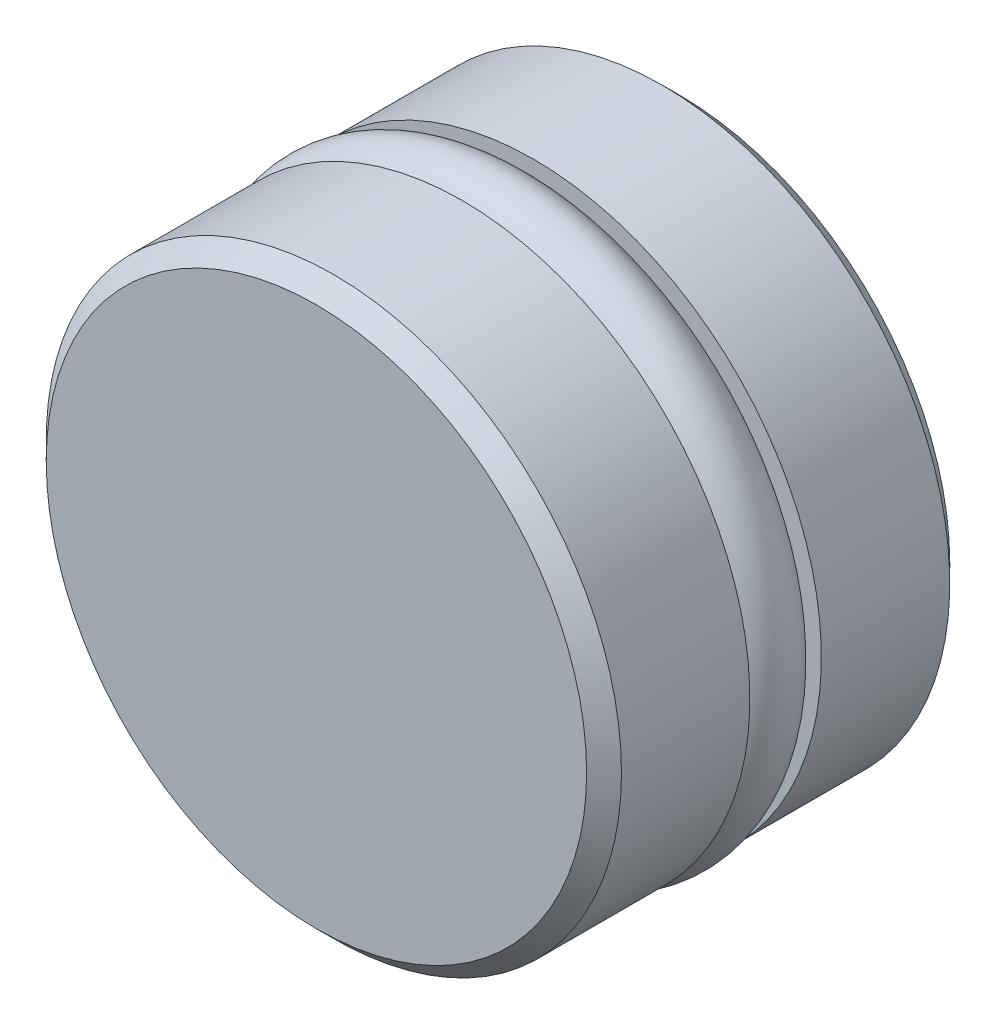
ISO-10303-21;
HEADER;
FILE_DESCRIPTION(('STEP AP214'),'2;1');
FILE_NAME('part.step','',(''),(''),'','','');
FILE_SCHEMA(('AUTOMOTIVE_DESIGN { 1 0 10303 214 1 1 1 1 }'));
ENDSEC;
DATA;
#1=APPLICATION_CONTEXT('core data for automotive mechanical design processes');
#2=APPLICATION_PROTOCOL_DEFINITION('international standard','automotive_design',2000,#1);
#3=PRODUCT_CONTEXT('',#1,'mechanical');
#4=PRODUCT('Part','Part','',(#3));
#5=PRODUCT_RELATED_PRODUCT_CATEGORY('part','',(#4));
#6=PRODUCT_DEFINITION_FORMATION('','',#4);
#7=PRODUCT_DEFINITION_CONTEXT('part definition',#1,'design');
#8=PRODUCT_DEFINITION('design','',#6,#7);
#9=PRODUCT_DEFINITION_SHAPE('','',#8);
#10=(LENGTH_UNIT() NAMED_UNIT(*) SI_UNIT(.MILLI.,.METRE.));
#11=(NAMED_UNIT(*) PLANE_ANGLE_UNIT() SI_UNIT($,.RADIAN.));
#12=(NAMED_UNIT(*) SI_UNIT($,.STERADIAN.) SOLID_ANGLE_UNIT());
#13=UNCERTAINTY_MEASURE_WITH_UNIT(LENGTH_MEASURE(1.E-05),#10,'distance_accuracy_value','');
#14=(GEOMETRIC_REPRESENTATION_CONTEXT(3) GLOBAL_UNCERTAINTY_ASSIGNED_CONTEXT((#13)) GLOBAL_UNIT_ASSIGNED_CONTEXT((#10,
#11,#12)) REPRESENTATION_CONTEXT('',''));
#15=CARTESIAN_POINT('',(0.,0.,0.));
#16=DIRECTION('',(0.,0.,1.));
#17=DIRECTION('',(1.,0.,0.));
#18=AXIS2_PLACEMENT_3D('',#15,#16,#17);
#19=CARTESIAN_POINT('',(0.,0.,7.9375));
#20=DIRECTION('',(0.,0.,-1.));
#21=DIRECTION('',(-1.,0.,0.));
#22=AXIS2_PLACEMENT_3D('',#19,#20,#21);
#23=TOROIDAL_SURFACE('',#22,11.2141,1.5875);
#24=CARTESIAN_POINT('',(-12.8016,0.,7.9375));
#25=VERTEX_POINT('',#24);
#26=VERTEX_LOOP('',#25);
#27=FACE_BOUND('',#26,.T.);
#28=ADVANCED_FACE('P0_F12',(#27),#23,.T.);
#29=CLOSED_SHELL('',(#28));
#30=MANIFOLD_SOLID_BREP('P0_B1',#29);
#31=CARTESIAN_POINT('',(0.,0.,9.59455189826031));
#32=DIRECTION('',(0.,0.,-1.));
#33=DIRECTION('',(-1.,0.,0.));
#34=AXIS2_PLACEMENT_3D('',#31,#32,#33);
#35=CONICAL_SURFACE('',#34,3.87095999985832,1.0274700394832);
#36=CARTESIAN_POINT('',(0.,0.,9.59455189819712));
#37=DIRECTION('',(0.,0.,-1.));
#38=DIRECTION('',(0.,1.,0.));
#39=AXIS2_PLACEMENT_3D('',#36,#37,#38);
#40=CIRCLE('',#39,3.87096);
#41=CARTESIAN_POINT('',(0.,3.87096,9.59455189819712));
#42=VERTEX_POINT('',#41);
#43=EDGE_CURVE('P1_E79',#42,#42,#40,.T.);
#44=ORIENTED_EDGE('',*,*,#43,.T.);
#45=EDGE_LOOP('',(#44));
#46=FACE_BOUND('',#45,.T.);
#47=CARTESIAN_POINT('',(5.6843418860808E-11,0.,11.932457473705));
#48=VERTEX_POINT('',#47);
#49=VERTEX_LOOP('',#48);
#50=FACE_BOUND('',#49,.T.);
#51=ADVANCED_FACE('P1_F15',(#46,#50),#35,.F.);
#52=CARTESIAN_POINT('',(0.,0.,4.79727594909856));
#53=DIRECTION('',(0.,0.,-1.));
#54=DIRECTION('',(0.,1.,0.));
#55=AXIS2_PLACEMENT_3D('',#52,#53,#54);
#56=CYLINDRICAL_SURFACE('',#55,3.87096);
#57=ORIENTED_EDGE('',*,*,#43,.F.);
#58=EDGE_LOOP('',(#57));
#59=FACE_BOUND('',#58,.T.);
#60=CARTESIAN_POINT('',(0.,0.,0.));
#61=DIRECTION('',(0.,0.,-1.));
#62=DIRECTION('',(0.,1.,0.));
#63=AXIS2_PLACEMENT_3D('',#60,#61,#62);
#64=CIRCLE('',#63,3.87096);
#65=CARTESIAN_POINT('',(0.,3.87096,0.));
#66=VERTEX_POINT('',#65);
#67=EDGE_CURVE('P1_E70',#66,#66,#64,.F.);
#68=ORIENTED_EDGE('',*,*,#67,.F.);
#69=EDGE_LOOP('',(#68));
#70=FACE_BOUND('',#69,.T.);
#71=ADVANCED_FACE('P1_F27',(#59,#70),#56,.F.);
#72=CARTESIAN_POINT('',(7.84098,0.,0.));
#73=DIRECTION('',(0.,0.,-1.));
#74=DIRECTION('',(-1.,0.,0.));
#75=AXIS2_PLACEMENT_3D('',#72,#73,#74);
#76=PLANE('',#75);
#77=ORIENTED_EDGE('',*,*,#67,.T.);
#78=EDGE_LOOP('',(#77));
#79=FACE_BOUND('',#78,.T.);
#80=CARTESIAN_POINT('',(0.,0.,0.));
#81=DIRECTION('',(0.,0.,1.));
#82=DIRECTION('',(0.,-1.,0.));
#83=AXIS2_PLACEMENT_3D('',#80,#81,#82);
#84=CIRCLE('',#83,11.811);
#85=CARTESIAN_POINT('',(0.,-11.811,0.));
#86=VERTEX_POINT('',#85);
#87=EDGE_CURVE('P1_E73',#86,#86,#84,.T.);
#88=ORIENTED_EDGE('',*,*,#87,.F.);
#89=EDGE_LOOP('',(#88));
#90=FACE_BOUND('',#89,.T.);
#91=ADVANCED_FACE('P1_F34',(#79,#90),#76,.T.);
#92=CARTESIAN_POINT('',(0.,0.,0.762));
#93=DIRECTION('',(0.,0.,1.));
#94=DIRECTION('',(0.,-1.,0.));
#95=AXIS2_PLACEMENT_3D('',#92,#93,#94);
#96=CONICAL_SURFACE('',#95,12.573,0.785398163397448);
#97=ORIENTED_EDGE('',*,*,#87,.T.);
#98=EDGE_LOOP('',(#97));
#99=FACE_BOUND('',#98,.T.);
#100=CARTESIAN_POINT('',(0.,0.,0.762));
#101=DIRECTION('',(0.,0.,-1.));
#102=DIRECTION('',(0.,1.,0.));
#103=AXIS2_PLACEMENT_3D('',#100,#101,#102);
#104=CIRCLE('',#103,12.573);
#105=CARTESIAN_POINT('',(0.,12.573,0.761999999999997));
#106=VERTEX_POINT('',#105);
#107=EDGE_CURVE('P1_E74',#106,#106,#104,.F.);
#108=ORIENTED_EDGE('',*,*,#107,.F.);
#109=EDGE_LOOP('',(#108));
#110=FACE_BOUND('',#109,.T.);
#111=ADVANCED_FACE('P1_F51',(#99,#110),#96,.T.);
#112=CARTESIAN_POINT('',(0.,0.,3.556));
#113=DIRECTION('',(0.,0.,-1.));
#114=DIRECTION('',(0.,1.,0.));
#115=AXIS2_PLACEMENT_3D('',#112,#113,#114);
#116=CYLINDRICAL_SURFACE('',#115,12.573);
#117=ORIENTED_EDGE('',*,*,#107,.T.);
#118=EDGE_LOOP('',(#117));
#119=FACE_BOUND('',#118,.T.);
#120=CARTESIAN_POINT('',(0.,0.,6.3754));
#121=DIRECTION('',(0.,0.,-1.));
#122=DIRECTION('',(0.,1.,0.));
#123=AXIS2_PLACEMENT_3D('',#120,#121,#122);
#124=CIRCLE('',#123,12.573);
#125=CARTESIAN_POINT('',(0.,12.573,6.3754));
#126=VERTEX_POINT('',#125);
#127=EDGE_CURVE('P1_E77',#126,#126,#124,.F.);
#128=ORIENTED_EDGE('',*,*,#127,.F.);
#129=EDGE_LOOP('',(#128));
#130=FACE_BOUND('',#129,.T.);
#131=ADVANCED_FACE('P1_F45',(#119,#130),#116,.T.);
#132=CARTESIAN_POINT('',(11.0998,0.,6.3754));
#133=DIRECTION('',(0.,0.,1.));
#134=DIRECTION('',(1.,0.,0.));
#135=AXIS2_PLACEMENT_3D('',#132,#133,#134);
#136=PLANE('',#135);
#137=CARTESIAN_POINT('',(0.,0.,6.3754));
#138=DIRECTION('',(0.,0.,1.));
#139=DIRECTION('',(1.,0.,0.));
#140=AXIS2_PLACEMENT_3D('',#137,#138,#139);
#141=CIRCLE('',#140,11.4969424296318);
#142=CARTESIAN_POINT('',(11.4969424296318,0.,6.3754));
#143=VERTEX_POINT('',#142);
#144=EDGE_CURVE('P1_E89',#143,#143,#141,.T.);
#145=ORIENTED_EDGE('',*,*,#144,.F.);
#146=EDGE_LOOP('',(#145));
#147=FACE_BOUND('',#146,.T.);
#148=ORIENTED_EDGE('',*,*,#127,.T.);
#149=EDGE_LOOP('',(#148));
#150=FACE_BOUND('',#149,.T.);
#151=ADVANCED_FACE('P1_F39',(#147,#150),#136,.T.);
#152=CARTESIAN_POINT('',(0.,0.,7.9375));
#153=DIRECTION('',(0.,0.,-1.));
#154=DIRECTION('',(-1.,0.,0.));
#155=AXIS2_PLACEMENT_3D('',#152,#153,#154);
#156=TOROIDAL_SURFACE('',#155,11.2141,1.5875);
#157=ORIENTED_EDGE('',*,*,#144,.T.);
#158=EDGE_LOOP('',(#157));
#159=FACE_BOUND('',#158,.T.);
#160=CARTESIAN_POINT('',(0.,0.,6.3754));
#161=DIRECTION('',(0.,0.,-1.));
#162=DIRECTION('',(-1.,0.,0.));
#163=AXIS2_PLACEMENT_3D('',#160,#161,#162);
#164=CIRCLE('',#163,10.9312575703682);
#165=CARTESIAN_POINT('',(-10.9312575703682,0.,6.3754));
#166=VERTEX_POINT('',#165);
#167=EDGE_CURVE('P1_E96',#166,#166,#164,.T.);
#168=ORIENTED_EDGE('',*,*,#167,.T.);
#169=EDGE_LOOP('',(#168));
#170=FACE_BOUND('',#169,.T.);
#171=ADVANCED_FACE('P1_F29',(#159,#170),#156,.F.);
#172=CARTESIAN_POINT('',(0.,0.,0.));
#173=DIRECTION('',(0.,0.,-1.));
#174=DIRECTION('',(-1.,0.,0.));
#175=AXIS2_PLACEMENT_3D('',#172,#173,#174);
#176=CYLINDRICAL_SURFACE('',#175,9.6393);
#177=CARTESIAN_POINT('',(0.,0.,6.3754));
#178=DIRECTION('',(0.,0.,-1.));
#179=DIRECTION('',(-1.,0.,0.));
#180=AXIS2_PLACEMENT_3D('',#177,#178,#179);
#181=CIRCLE('',#180,9.6393);
#182=CARTESIAN_POINT('',(-9.6393,0.,6.3754));
#183=VERTEX_POINT('',#182);
#184=EDGE_CURVE('P1_E83',#183,#183,#181,.T.);
#185=ORIENTED_EDGE('',*,*,#184,.F.);
#186=EDGE_LOOP('',(#185));
#187=FACE_BOUND('',#186,.T.);
#188=CARTESIAN_POINT('',(0.,0.,9.4996));
#189=DIRECTION('',(0.,0.,-1.));
#190=DIRECTION('',(-1.,0.,0.));
#191=AXIS2_PLACEMENT_3D('',#188,#189,#190);
#192=CIRCLE('',#191,9.6393);
#193=CARTESIAN_POINT('',(-9.6393,0.,9.4996));
#194=VERTEX_POINT('',#193);
#195=EDGE_CURVE('P1_E18',#194,#194,#192,.F.);
#196=ORIENTED_EDGE('',*,*,#195,.F.);
#197=EDGE_LOOP('',(#196));
#198=FACE_BOUND('',#197,.T.);
#199=ADVANCED_FACE('P1_F38',(#187,#198),#176,.T.);
#200=CARTESIAN_POINT('',(11.0998,0.,6.3754));
#201=DIRECTION('',(0.,0.,1.));
#202=DIRECTION('',(1.,0.,0.));
#203=AXIS2_PLACEMENT_3D('',#200,#201,#202);
#204=PLANE('',#203);
#205=ORIENTED_EDGE('',*,*,#167,.F.);
#206=EDGE_LOOP('',(#205));
#207=FACE_BOUND('',#206,.T.);
#208=ORIENTED_EDGE('',*,*,#184,.T.);
#209=EDGE_LOOP('',(#208));
#210=FACE_BOUND('',#209,.T.);
#211=ADVANCED_FACE('P1_F43',(#207,#210),#204,.T.);
#212=CARTESIAN_POINT('',(11.0998,0.,9.4996));
#213=DIRECTION('',(0.,0.,-1.));
#214=DIRECTION('',(-1.,0.,0.));
#215=AXIS2_PLACEMENT_3D('',#212,#213,#214);
#216=PLANE('',#215);
#217=CARTESIAN_POINT('',(0.,0.,9.4996));
#218=DIRECTION('',(0.,0.,1.));
#219=DIRECTION('',(1.,0.,0.));
#220=AXIS2_PLACEMENT_3D('',#217,#218,#219);
#221=CIRCLE('',#220,10.9312575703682);
#222=CARTESIAN_POINT('',(10.9312575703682,0.,9.4996));
#223=VERTEX_POINT('',#222);
#224=EDGE_CURVE('P1_E125',#223,#223,#221,.T.);
#225=ORIENTED_EDGE('',*,*,#224,.F.);
#226=EDGE_LOOP('',(#225));
#227=FACE_BOUND('',#226,.T.);
#228=ORIENTED_EDGE('',*,*,#195,.T.);
#229=EDGE_LOOP('',(#228));
#230=FACE_BOUND('',#229,.T.);
#231=ADVANCED_FACE('P1_F122',(#227,#230),#216,.T.);
#232=CARTESIAN_POINT('',(0.,0.,9.4996));
#233=DIRECTION('',(0.,0.,-1.));
#234=DIRECTION('',(-1.,0.,0.));
#235=AXIS2_PLACEMENT_3D('',#232,#233,#234);
#236=CIRCLE('',#235,11.4969424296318);
#237=CARTESIAN_POINT('',(-11.4969424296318,0.,9.4996));
#238=VERTEX_POINT('',#237);
#239=EDGE_CURVE('P1_E93',#238,#238,#236,.T.);
#240=ORIENTED_EDGE('',*,*,#239,.T.);
#241=EDGE_LOOP('',(#240));
#242=FACE_BOUND('',#241,.T.);
#243=ORIENTED_EDGE('',*,*,#224,.T.);
#244=EDGE_LOOP('',(#243));
#245=FACE_BOUND('',#244,.T.);
#246=ADVANCED_FACE('P1_F42',(#242,#245),#156,.F.);
#247=CARTESIAN_POINT('',(5.9055,0.,15.875));
#248=DIRECTION('',(0.,0.,1.));
#249=DIRECTION('',(1.,0.,0.));
#250=AXIS2_PLACEMENT_3D('',#247,#248,#249);
#251=PLANE('',#250);
#252=CARTESIAN_POINT('',(0.,0.,15.875));
#253=DIRECTION('',(0.,0.,-1.));
#254=DIRECTION('',(0.,1.,0.));
#255=AXIS2_PLACEMENT_3D('',#252,#253,#254);
#256=CIRCLE('',#255,11.811);
#257=CARTESIAN_POINT('',(0.,11.811,15.875));
#258=VERTEX_POINT('',#257);
#259=EDGE_CURVE('P1_E10',#258,#258,#256,.F.);
#260=ORIENTED_EDGE('',*,*,#259,.T.);
#261=EDGE_LOOP('',(#260));
#262=FACE_BOUND('',#261,.T.);
#263=ADVANCED_FACE('P1_F121',(#262),#251,.T.);
#264=CARTESIAN_POINT('',(0.,0.,15.113));
#265=DIRECTION('',(0.,0.,-1.));
#266=DIRECTION('',(0.,1.,0.));
#267=AXIS2_PLACEMENT_3D('',#264,#265,#266);
#268=CONICAL_SURFACE('',#267,12.573,0.785398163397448);
#269=CARTESIAN_POINT('',(0.,0.,15.113));
#270=DIRECTION('',(0.,0.,-1.));
#271=DIRECTION('',(1.,0.,0.));
#272=AXIS2_PLACEMENT_3D('',#269,#270,#271);
#273=CIRCLE('',#272,12.573);
#274=CARTESIAN_POINT('',(12.573,0.,15.113));
#275=VERTEX_POINT('',#274);
#276=EDGE_CURVE('P1_E22',#275,#275,#273,.F.);
#277=ORIENTED_EDGE('',*,*,#276,.T.);
#278=EDGE_LOOP('',(#277));
#279=FACE_BOUND('',#278,.T.);
#280=ORIENTED_EDGE('',*,*,#259,.F.);
#281=EDGE_LOOP('',(#280));
#282=FACE_BOUND('',#281,.T.);
#283=ADVANCED_FACE('P1_F116',(#279,#282),#268,.T.);
#284=CARTESIAN_POINT('',(0.,0.,12.319));
#285=DIRECTION('',(0.,0.,-1.));
#286=DIRECTION('',(0.,1.,0.));
#287=AXIS2_PLACEMENT_3D('',#284,#285,#286);
#288=CYLINDRICAL_SURFACE('',#287,12.573);
#289=CARTESIAN_POINT('',(0.,0.,9.4996));
#290=DIRECTION('',(0.,0.,-1.));
#291=DIRECTION('',(0.,1.,0.));
#292=AXIS2_PLACEMENT_3D('',#289,#290,#291);
#293=CIRCLE('',#292,12.573);
#294=CARTESIAN_POINT('',(0.,12.573,9.4996));
#295=VERTEX_POINT('',#294);
#296=EDGE_CURVE('P1_E101',#295,#295,#293,.F.);
#297=ORIENTED_EDGE('',*,*,#296,.T.);
#298=EDGE_LOOP('',(#297));
#299=FACE_BOUND('',#298,.T.);
#300=ORIENTED_EDGE('',*,*,#276,.F.);
#301=EDGE_LOOP('',(#300));
#302=FACE_BOUND('',#301,.T.);
#303=ADVANCED_FACE('P1_F108',(#299,#302),#288,.T.);
#304=CARTESIAN_POINT('',(11.0998,0.,9.4996));
#305=DIRECTION('',(0.,0.,-1.));
#306=DIRECTION('',(-1.,0.,0.));
#307=AXIS2_PLACEMENT_3D('',#304,#305,#306);
#308=PLANE('',#307);
#309=ORIENTED_EDGE('',*,*,#239,.F.);
#310=EDGE_LOOP('',(#309));
#311=FACE_BOUND('',#310,.T.);
#312=ORIENTED_EDGE('',*,*,#296,.F.);
#313=EDGE_LOOP('',(#312));
#314=FACE_BOUND('',#313,.T.);
#315=ADVANCED_FACE('P1_F57',(#311,#314),#308,.T.);
#316=CLOSED_SHELL('',(#51,#71,#91,#111,#131,#151,#171,#199,#211,#231,#246,#263,#283,#303,#315));
#317=MANIFOLD_SOLID_BREP('P1_B1',#316);
#318=ADVANCED_BREP_SHAPE_REPRESENTATION('',(#18,#30,#317),#14);
#319=SHAPE_DEFINITION_REPRESENTATION(#9,#318);
ENDSEC;
END-ISO-10303-21;
